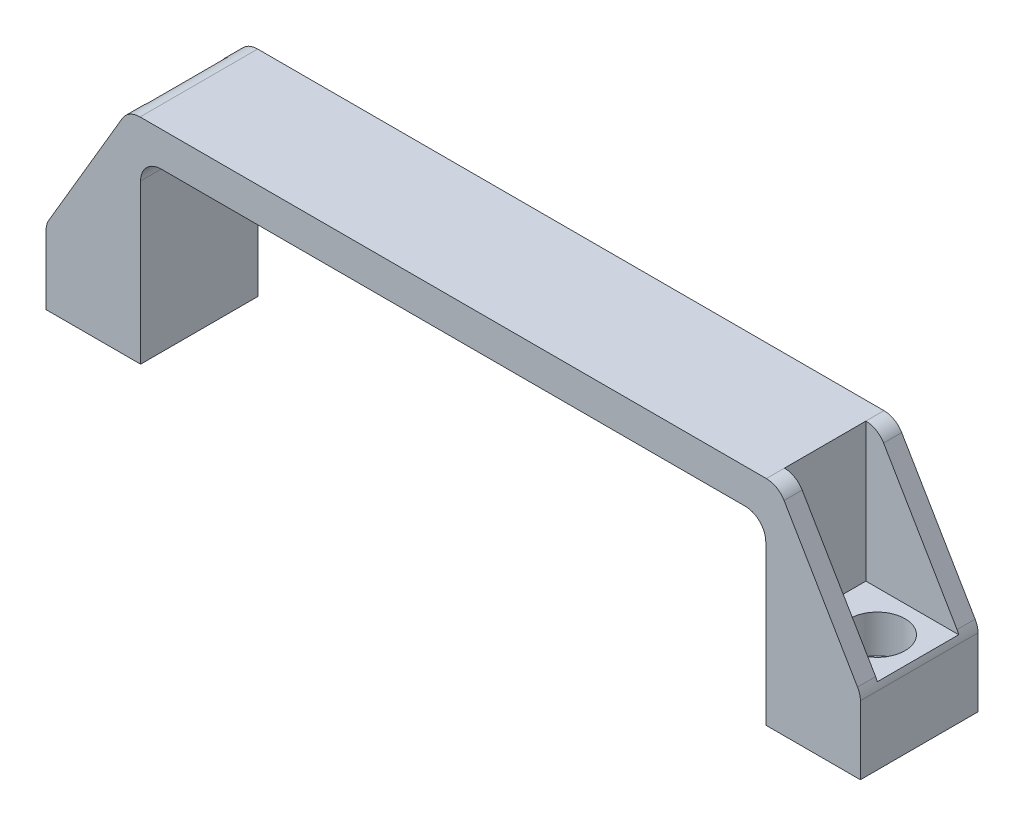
ISO-10303-21;
HEADER;
FILE_DESCRIPTION(('STEP AP214'),'2;1');
FILE_NAME('part.step','',(''),(''),'','','');
FILE_SCHEMA(('AUTOMOTIVE_DESIGN { 1 0 10303 214 1 1 1 1 }'));
ENDSEC;
DATA;
#1=APPLICATION_CONTEXT('core data for automotive mechanical design processes');
#2=APPLICATION_PROTOCOL_DEFINITION('international standard','automotive_design',2000,#1);
#3=PRODUCT_CONTEXT('',#1,'mechanical');
#4=PRODUCT('Part','Part','',(#3));
#5=PRODUCT_RELATED_PRODUCT_CATEGORY('part','',(#4));
#6=PRODUCT_DEFINITION_FORMATION('','',#4);
#7=PRODUCT_DEFINITION_CONTEXT('part definition',#1,'design');
#8=PRODUCT_DEFINITION('design','',#6,#7);
#9=PRODUCT_DEFINITION_SHAPE('','',#8);
#10=(LENGTH_UNIT() NAMED_UNIT(*) SI_UNIT(.MILLI.,.METRE.));
#11=(NAMED_UNIT(*) PLANE_ANGLE_UNIT() SI_UNIT($,.RADIAN.));
#12=(NAMED_UNIT(*) SI_UNIT($,.STERADIAN.) SOLID_ANGLE_UNIT());
#13=UNCERTAINTY_MEASURE_WITH_UNIT(LENGTH_MEASURE(1.E-05),#10,'distance_accuracy_value','');
#14=(GEOMETRIC_REPRESENTATION_CONTEXT(3) GLOBAL_UNCERTAINTY_ASSIGNED_CONTEXT((#13)) GLOBAL_UNIT_ASSIGNED_CONTEXT((#10,
#11,#12)) REPRESENTATION_CONTEXT('',''));
#15=CARTESIAN_POINT('',(0.,0.,0.));
#16=DIRECTION('',(0.,0.,1.));
#17=DIRECTION('',(1.,0.,0.));
#18=AXIS2_PLACEMENT_3D('',#15,#16,#17);
#19=CARTESIAN_POINT('',(187.8,0.,14.3));
#20=DIRECTION('',(0.,1.,0.));
#21=DIRECTION('',(-1.,0.,0.));
#22=AXIS2_PLACEMENT_3D('',#19,#20,#21);
#23=CYLINDRICAL_SURFACE('',#22,4.09999999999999);
#24=CARTESIAN_POINT('',(187.8,0.,14.3));
#25=DIRECTION('',(0.,1.,0.));
#26=DIRECTION('',(-1.,0.,0.));
#27=AXIS2_PLACEMENT_3D('',#24,#25,#26);
#28=CIRCLE('',#27,4.09999999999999);
#29=CARTESIAN_POINT('',(183.7,0.,14.3));
#30=VERTEX_POINT('',#29);
#31=EDGE_CURVE('E229',#30,#30,#28,.T.);
#32=ORIENTED_EDGE('',*,*,#31,.F.);
#33=EDGE_LOOP('',(#32));
#34=FACE_BOUND('',#33,.T.);
#35=CARTESIAN_POINT('',(187.8,9.10000000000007,14.3));
#36=DIRECTION('',(0.,1.,0.));
#37=DIRECTION('',(-1.,0.,0.));
#38=AXIS2_PLACEMENT_3D('',#35,#36,#37);
#39=CIRCLE('',#38,4.09999999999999);
#40=CARTESIAN_POINT('',(183.7,9.10000000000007,14.3));
#41=VERTEX_POINT('',#40);
#42=EDGE_CURVE('E36',#41,#41,#39,.F.);
#43=ORIENTED_EDGE('',*,*,#42,.F.);
#44=EDGE_LOOP('',(#43));
#45=FACE_BOUND('',#44,.T.);
#46=ADVANCED_FACE('F32',(#34,#45),#23,.F.);
#47=CARTESIAN_POINT('',(10.2,0.,14.3));
#48=DIRECTION('',(0.,1.,0.));
#49=DIRECTION('',(-1.,0.,0.));
#50=AXIS2_PLACEMENT_3D('',#47,#48,#49);
#51=CYLINDRICAL_SURFACE('',#50,4.1);
#52=CARTESIAN_POINT('',(10.2,0.,14.3));
#53=DIRECTION('',(0.,1.,0.));
#54=DIRECTION('',(-1.,0.,0.));
#55=AXIS2_PLACEMENT_3D('',#52,#53,#54);
#56=CIRCLE('',#55,4.1);
#57=CARTESIAN_POINT('',(6.1,0.,14.3));
#58=VERTEX_POINT('',#57);
#59=EDGE_CURVE('E226',#58,#58,#56,.T.);
#60=ORIENTED_EDGE('',*,*,#59,.F.);
#61=EDGE_LOOP('',(#60));
#62=FACE_BOUND('',#61,.T.);
#63=CARTESIAN_POINT('',(10.2,9.1,14.3));
#64=DIRECTION('',(0.,1.,0.));
#65=DIRECTION('',(-1.,0.,0.));
#66=AXIS2_PLACEMENT_3D('',#63,#64,#65);
#67=CIRCLE('',#66,4.1);
#68=CARTESIAN_POINT('',(6.1,9.1,14.3));
#69=VERTEX_POINT('',#68);
#70=EDGE_CURVE('E403',#69,#69,#67,.F.);
#71=ORIENTED_EDGE('',*,*,#70,.F.);
#72=EDGE_LOOP('',(#71));
#73=FACE_BOUND('',#72,.T.);
#74=ADVANCED_FACE('F430',(#62,#73),#51,.F.);
#75=CARTESIAN_POINT('',(0.,18.,28.6));
#76=DIRECTION('',(0.86193421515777,-0.507020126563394,0.));
#77=DIRECTION('',(0.507020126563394,0.86193421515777,0.));
#78=AXIS2_PLACEMENT_3D('',#75,#76,#77);
#79=PLANE('',#78);
#80=DIRECTION('',(0.,0.,-1.));
#81=VECTOR('',#80,1.);
#82=CARTESIAN_POINT('',(18.5500591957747,49.535100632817,28.6));
#83=LINE('',#82,#81);
#84=CARTESIAN_POINT('',(18.5500591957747,49.535100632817,28.6));
#85=VERTEX_POINT('',#84);
#86=CARTESIAN_POINT('',(18.5500591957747,49.535100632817,24.2));
#87=VERTEX_POINT('',#86);
#88=EDGE_CURVE('E345',#85,#87,#83,.T.);
#89=ORIENTED_EDGE('',*,*,#88,.T.);
#90=DIRECTION('',(-0.507020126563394,-0.86193421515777,0.));
#91=VECTOR('',#90,1.);
#92=CARTESIAN_POINT('',(0.,18.,24.2));
#93=LINE('',#92,#91);
#94=CARTESIAN_POINT('',(0.690328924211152,19.173559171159,24.2));
#95=VERTEX_POINT('',#94);
#96=EDGE_CURVE('E240',#87,#95,#93,.T.);
#97=ORIENTED_EDGE('',*,*,#96,.T.);
#98=DIRECTION('',(0.,0.,-1.));
#99=VECTOR('',#98,1.);
#100=CARTESIAN_POINT('',(0.690328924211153,19.173559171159,28.6));
#101=LINE('',#100,#99);
#102=CARTESIAN_POINT('',(0.690328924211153,19.173559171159,28.6));
#103=VERTEX_POINT('',#102);
#104=EDGE_CURVE('E379',#95,#103,#101,.F.);
#105=ORIENTED_EDGE('',*,*,#104,.T.);
#106=DIRECTION('',(-0.507020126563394,-0.86193421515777,0.));
#107=VECTOR('',#106,1.);
#108=CARTESIAN_POINT('',(0.,18.,28.6));
#109=LINE('',#108,#107);
#110=EDGE_CURVE('E293',#85,#103,#109,.T.);
#111=ORIENTED_EDGE('',*,*,#110,.F.);
#112=EDGE_LOOP('',(#89,#97,#105,#111));
#113=FACE_BOUND('',#112,.T.);
#114=ADVANCED_FACE('F436',(#113),#79,.F.);
#115=CARTESIAN_POINT('',(198.,18.,28.6));
#116=DIRECTION('',(-0.861934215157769,-0.507020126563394,0.));
#117=DIRECTION('',(0.507020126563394,-0.861934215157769,0.));
#118=AXIS2_PLACEMENT_3D('',#115,#116,#117);
#119=PLANE('',#118);
#120=DIRECTION('',(0.,0.,-1.));
#121=VECTOR('',#120,1.);
#122=CARTESIAN_POINT('',(179.449940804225,49.535100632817,28.6));
#123=LINE('',#122,#121);
#124=CARTESIAN_POINT('',(179.449940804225,49.535100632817,0.));
#125=VERTEX_POINT('',#124);
#126=CARTESIAN_POINT('',(179.449940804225,49.535100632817,4.4));
#127=VERTEX_POINT('',#126);
#128=EDGE_CURVE('E339',#125,#127,#123,.F.);
#129=ORIENTED_EDGE('',*,*,#128,.T.);
#130=DIRECTION('',(0.507020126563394,-0.861934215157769,0.));
#131=VECTOR('',#130,1.);
#132=CARTESIAN_POINT('',(198.,18.,4.4));
#133=LINE('',#132,#131);
#134=CARTESIAN_POINT('',(197.309671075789,19.173559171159,4.4));
#135=VERTEX_POINT('',#134);
#136=EDGE_CURVE('E263',#127,#135,#133,.T.);
#137=ORIENTED_EDGE('',*,*,#136,.T.);
#138=DIRECTION('',(0.,0.,-1.));
#139=VECTOR('',#138,1.);
#140=CARTESIAN_POINT('',(197.309671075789,19.173559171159,28.6));
#141=LINE('',#140,#139);
#142=CARTESIAN_POINT('',(197.309671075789,19.173559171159,0.));
#143=VERTEX_POINT('',#142);
#144=EDGE_CURVE('E387',#135,#143,#141,.T.);
#145=ORIENTED_EDGE('',*,*,#144,.T.);
#146=DIRECTION('',(-0.507020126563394,0.861934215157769,0.));
#147=VECTOR('',#146,1.);
#148=CARTESIAN_POINT('',(198.,18.,0.));
#149=LINE('',#148,#147);
#150=EDGE_CURVE('E313',#143,#125,#149,.T.);
#151=ORIENTED_EDGE('',*,*,#150,.T.);
#152=EDGE_LOOP('',(#129,#137,#145,#151));
#153=FACE_BOUND('',#152,.T.);
#154=ADVANCED_FACE('F494',(#153),#119,.F.);
#155=CARTESIAN_POINT('',(175.140269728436,47.,28.6));
#156=DIRECTION('',(0.,0.,-1.));
#157=DIRECTION('',(-1.,0.,0.));
#158=AXIS2_PLACEMENT_3D('',#155,#156,#157);
#159=CYLINDRICAL_SURFACE('',#158,5.);
#160=CARTESIAN_POINT('',(175.140269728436,47.,4.4));
#161=DIRECTION('',(0.,0.,-1.));
#162=DIRECTION('',(-1.,0.,0.));
#163=AXIS2_PLACEMENT_3D('',#160,#161,#162);
#164=CIRCLE('',#163,5.);
#165=CARTESIAN_POINT('',(175.140269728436,52.,4.4));
#166=VERTEX_POINT('',#165);
#167=EDGE_CURVE('E266',#127,#166,#164,.F.);
#168=ORIENTED_EDGE('',*,*,#167,.F.);
#169=ORIENTED_EDGE('',*,*,#128,.F.);
#170=CARTESIAN_POINT('',(175.140269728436,47.,0.));
#171=DIRECTION('',(0.,0.,-1.));
#172=DIRECTION('',(-1.,0.,0.));
#173=AXIS2_PLACEMENT_3D('',#170,#171,#172);
#174=CIRCLE('',#173,5.);
#175=CARTESIAN_POINT('',(175.140269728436,52.,0.));
#176=VERTEX_POINT('',#175);
#177=EDGE_CURVE('E335',#176,#125,#174,.T.);
#178=ORIENTED_EDGE('',*,*,#177,.F.);
#179=DIRECTION('',(0.,0.,-1.));
#180=VECTOR('',#179,1.);
#181=CARTESIAN_POINT('',(175.140269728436,52.,28.6));
#182=LINE('',#181,#180);
#183=EDGE_CURVE('E331',#166,#176,#182,.T.);
#184=ORIENTED_EDGE('',*,*,#183,.F.);
#185=EDGE_LOOP('',(#168,#169,#178,#184));
#186=FACE_BOUND('',#185,.T.);
#187=ADVANCED_FACE('F521',(#186),#159,.T.);
#188=CARTESIAN_POINT('',(0.,0.,28.6));
#189=DIRECTION('',(1.,0.,0.));
#190=DIRECTION('',(0.,0.,-1.));
#191=AXIS2_PLACEMENT_3D('',#188,#189,#190);
#192=PLANE('',#191);
#193=DIRECTION('',(0.,-1.,0.));
#194=VECTOR('',#193,1.);
#195=CARTESIAN_POINT('',(0.,0.,28.6));
#196=LINE('',#195,#194);
#197=CARTESIAN_POINT('',(0.,16.638458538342,28.6));
#198=VERTEX_POINT('',#197);
#199=CARTESIAN_POINT('',(0.,0.,28.6));
#200=VERTEX_POINT('',#199);
#201=EDGE_CURVE('E269',#198,#200,#196,.T.);
#202=ORIENTED_EDGE('',*,*,#201,.F.);
#203=DIRECTION('',(0.,0.,-1.));
#204=VECTOR('',#203,1.);
#205=CARTESIAN_POINT('',(0.,16.638458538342,28.6));
#206=LINE('',#205,#204);
#207=CARTESIAN_POINT('',(0.,16.638458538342,0.));
#208=VERTEX_POINT('',#207);
#209=EDGE_CURVE('E372',#198,#208,#206,.T.);
#210=ORIENTED_EDGE('',*,*,#209,.T.);
#211=DIRECTION('',(0.,-1.,0.));
#212=VECTOR('',#211,1.);
#213=CARTESIAN_POINT('',(0.,0.,0.));
#214=LINE('',#213,#212);
#215=CARTESIAN_POINT('',(0.,0.,0.));
#216=VERTEX_POINT('',#215);
#217=EDGE_CURVE('E268',#208,#216,#214,.T.);
#218=ORIENTED_EDGE('',*,*,#217,.T.);
#219=DIRECTION('',(0.,0.,-1.));
#220=VECTOR('',#219,1.);
#221=CARTESIAN_POINT('',(0.,0.,28.6));
#222=LINE('',#221,#220);
#223=EDGE_CURVE('E328',#200,#216,#222,.T.);
#224=ORIENTED_EDGE('',*,*,#223,.F.);
#225=EDGE_LOOP('',(#202,#210,#218,#224));
#226=FACE_BOUND('',#225,.T.);
#227=ADVANCED_FACE('F517',(#226),#192,.F.);
#228=CARTESIAN_POINT('',(0.,0.,28.6));
#229=DIRECTION('',(0.,1.,0.));
#230=DIRECTION('',(0.,0.,1.));
#231=AXIS2_PLACEMENT_3D('',#228,#229,#230);
#232=PLANE('',#231);
#233=ORIENTED_EDGE('',*,*,#59,.T.);
#234=EDGE_LOOP('',(#233));
#235=FACE_BOUND('',#234,.T.);
#236=DIRECTION('',(1.,0.,0.));
#237=VECTOR('',#236,1.);
#238=CARTESIAN_POINT('',(0.,0.,0.));
#239=LINE('',#238,#237);
#240=CARTESIAN_POINT('',(23.,0.,0.));
#241=VERTEX_POINT('',#240);
#242=EDGE_CURVE('E298',#216,#241,#239,.T.);
#243=ORIENTED_EDGE('',*,*,#242,.T.);
#244=DIRECTION('',(0.,0.,-1.));
#245=VECTOR('',#244,1.);
#246=CARTESIAN_POINT('',(23.,0.,28.6));
#247=LINE('',#246,#245);
#248=CARTESIAN_POINT('',(23.,0.,28.6));
#249=VERTEX_POINT('',#248);
#250=EDGE_CURVE('E325',#249,#241,#247,.T.);
#251=ORIENTED_EDGE('',*,*,#250,.F.);
#252=DIRECTION('',(1.,0.,0.));
#253=VECTOR('',#252,1.);
#254=CARTESIAN_POINT('',(0.,0.,28.6));
#255=LINE('',#254,#253);
#256=EDGE_CURVE('E271',#200,#249,#255,.T.);
#257=ORIENTED_EDGE('',*,*,#256,.F.);
#258=ORIENTED_EDGE('',*,*,#223,.T.);
#259=EDGE_LOOP('',(#243,#251,#257,#258));
#260=FACE_BOUND('',#259,.T.);
#261=ADVANCED_FACE('F513',(#235,#260),#232,.F.);
#262=CARTESIAN_POINT('',(23.,0.,28.6));
#263=DIRECTION('',(-1.,0.,0.));
#264=DIRECTION('',(0.,0.,1.));
#265=AXIS2_PLACEMENT_3D('',#262,#263,#264);
#266=PLANE('',#265);
#267=DIRECTION('',(0.,1.,0.));
#268=VECTOR('',#267,1.);
#269=CARTESIAN_POINT('',(23.,0.,0.));
#270=LINE('',#269,#268);
#271=CARTESIAN_POINT('',(23.,38.6,0.));
#272=VERTEX_POINT('',#271);
#273=EDGE_CURVE('E300',#241,#272,#270,.T.);
#274=ORIENTED_EDGE('',*,*,#273,.T.);
#275=DIRECTION('',(0.,0.,-1.));
#276=VECTOR('',#275,1.);
#277=CARTESIAN_POINT('',(23.,38.6,28.6));
#278=LINE('',#277,#276);
#279=CARTESIAN_POINT('',(23.,38.6,28.6));
#280=VERTEX_POINT('',#279);
#281=EDGE_CURVE('E359',#272,#280,#278,.F.);
#282=ORIENTED_EDGE('',*,*,#281,.T.);
#283=DIRECTION('',(0.,1.,0.));
#284=VECTOR('',#283,1.);
#285=CARTESIAN_POINT('',(23.,0.,28.6));
#286=LINE('',#285,#284);
#287=EDGE_CURVE('E274',#249,#280,#286,.T.);
#288=ORIENTED_EDGE('',*,*,#287,.F.);
#289=ORIENTED_EDGE('',*,*,#250,.T.);
#290=EDGE_LOOP('',(#274,#282,#288,#289));
#291=FACE_BOUND('',#290,.T.);
#292=ADVANCED_FACE('F509',(#291),#266,.F.);
#293=CARTESIAN_POINT('',(23.,43.6,28.6));
#294=DIRECTION('',(0.,1.,0.));
#295=DIRECTION('',(-1.,0.,0.));
#296=AXIS2_PLACEMENT_3D('',#293,#294,#295);
#297=PLANE('',#296);
#298=DIRECTION('',(1.,0.,0.));
#299=VECTOR('',#298,1.);
#300=CARTESIAN_POINT('',(23.,43.6,28.6));
#301=LINE('',#300,#299);
#302=CARTESIAN_POINT('',(28.,43.6,28.6));
#303=VERTEX_POINT('',#302);
#304=CARTESIAN_POINT('',(170.,43.6,28.6));
#305=VERTEX_POINT('',#304);
#306=EDGE_CURVE('E277',#303,#305,#301,.T.);
#307=ORIENTED_EDGE('',*,*,#306,.F.);
#308=DIRECTION('',(0.,0.,-1.));
#309=VECTOR('',#308,1.);
#310=CARTESIAN_POINT('',(28.,43.6,0.));
#311=LINE('',#310,#309);
#312=CARTESIAN_POINT('',(28.,43.6,0.));
#313=VERTEX_POINT('',#312);
#314=EDGE_CURVE('E356',#303,#313,#311,.T.);
#315=ORIENTED_EDGE('',*,*,#314,.T.);
#316=DIRECTION('',(1.,0.,0.));
#317=VECTOR('',#316,1.);
#318=CARTESIAN_POINT('',(23.,43.6,0.));
#319=LINE('',#318,#317);
#320=CARTESIAN_POINT('',(170.,43.6,0.));
#321=VERTEX_POINT('',#320);
#322=EDGE_CURVE('E303',#313,#321,#319,.T.);
#323=ORIENTED_EDGE('',*,*,#322,.T.);
#324=DIRECTION('',(0.,0.,-1.));
#325=VECTOR('',#324,1.);
#326=CARTESIAN_POINT('',(170.,43.6,28.6));
#327=LINE('',#326,#325);
#328=EDGE_CURVE('E354',#321,#305,#327,.F.);
#329=ORIENTED_EDGE('',*,*,#328,.T.);
#330=EDGE_LOOP('',(#307,#315,#323,#329));
#331=FACE_BOUND('',#330,.T.);
#332=ADVANCED_FACE('F505',(#331),#297,.F.);
#333=CARTESIAN_POINT('',(175.,0.,28.6));
#334=DIRECTION('',(1.,0.,0.));
#335=DIRECTION('',(0.,0.,-1.));
#336=AXIS2_PLACEMENT_3D('',#333,#334,#335);
#337=PLANE('',#336);
#338=DIRECTION('',(0.,-1.,0.));
#339=VECTOR('',#338,1.);
#340=CARTESIAN_POINT('',(175.,0.,28.6));
#341=LINE('',#340,#339);
#342=CARTESIAN_POINT('',(175.,38.6,28.6));
#343=VERTEX_POINT('',#342);
#344=CARTESIAN_POINT('',(175.,0.,28.6));
#345=VERTEX_POINT('',#344);
#346=EDGE_CURVE('E280',#343,#345,#341,.T.);
#347=ORIENTED_EDGE('',*,*,#346,.F.);
#348=DIRECTION('',(0.,0.,-1.));
#349=VECTOR('',#348,1.);
#350=CARTESIAN_POINT('',(175.,38.6,0.));
#351=LINE('',#350,#349);
#352=CARTESIAN_POINT('',(175.,38.6,0.));
#353=VERTEX_POINT('',#352);
#354=EDGE_CURVE('E361',#343,#353,#351,.T.);
#355=ORIENTED_EDGE('',*,*,#354,.T.);
#356=DIRECTION('',(0.,-1.,0.));
#357=VECTOR('',#356,1.);
#358=CARTESIAN_POINT('',(175.,0.,0.));
#359=LINE('',#358,#357);
#360=CARTESIAN_POINT('',(175.,0.,0.));
#361=VERTEX_POINT('',#360);
#362=EDGE_CURVE('E306',#353,#361,#359,.T.);
#363=ORIENTED_EDGE('',*,*,#362,.T.);
#364=DIRECTION('',(0.,0.,-1.));
#365=VECTOR('',#364,1.);
#366=CARTESIAN_POINT('',(175.,0.,28.6));
#367=LINE('',#366,#365);
#368=EDGE_CURVE('E322',#345,#361,#367,.T.);
#369=ORIENTED_EDGE('',*,*,#368,.F.);
#370=EDGE_LOOP('',(#347,#355,#363,#369));
#371=FACE_BOUND('',#370,.T.);
#372=ADVANCED_FACE('F501',(#371),#337,.F.);
#373=CARTESIAN_POINT('',(198.,0.,28.6));
#374=DIRECTION('',(0.,1.,0.));
#375=DIRECTION('',(-1.,0.,0.));
#376=AXIS2_PLACEMENT_3D('',#373,#374,#375);
#377=PLANE('',#376);
#378=ORIENTED_EDGE('',*,*,#31,.T.);
#379=EDGE_LOOP('',(#378));
#380=FACE_BOUND('',#379,.T.);
#381=DIRECTION('',(1.,0.,0.));
#382=VECTOR('',#381,1.);
#383=CARTESIAN_POINT('',(198.,0.,0.));
#384=LINE('',#383,#382);
#385=CARTESIAN_POINT('',(198.,0.,0.));
#386=VERTEX_POINT('',#385);
#387=EDGE_CURVE('E308',#361,#386,#384,.T.);
#388=ORIENTED_EDGE('',*,*,#387,.T.);
#389=DIRECTION('',(0.,0.,-1.));
#390=VECTOR('',#389,1.);
#391=CARTESIAN_POINT('',(198.,0.,28.6));
#392=LINE('',#391,#390);
#393=CARTESIAN_POINT('',(198.,0.,28.6));
#394=VERTEX_POINT('',#393);
#395=EDGE_CURVE('E296',#394,#386,#392,.T.);
#396=ORIENTED_EDGE('',*,*,#395,.F.);
#397=DIRECTION('',(1.,0.,0.));
#398=VECTOR('',#397,1.);
#399=CARTESIAN_POINT('',(198.,0.,28.6));
#400=LINE('',#399,#398);
#401=EDGE_CURVE('E282',#345,#394,#400,.T.);
#402=ORIENTED_EDGE('',*,*,#401,.F.);
#403=ORIENTED_EDGE('',*,*,#368,.T.);
#404=EDGE_LOOP('',(#388,#396,#402,#403));
#405=FACE_BOUND('',#404,.T.);
#406=ADVANCED_FACE('F497',(#380,#405),#377,.F.);
#407=CARTESIAN_POINT('',(198.,0.,28.6));
#408=DIRECTION('',(-1.,0.,0.));
#409=DIRECTION('',(0.,0.,1.));
#410=AXIS2_PLACEMENT_3D('',#407,#408,#409);
#411=PLANE('',#410);
#412=DIRECTION('',(0.,1.,0.));
#413=VECTOR('',#412,1.);
#414=CARTESIAN_POINT('',(198.,0.,0.));
#415=LINE('',#414,#413);
#416=CARTESIAN_POINT('',(198.,16.638458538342,0.));
#417=VERTEX_POINT('',#416);
#418=EDGE_CURVE('E310',#386,#417,#415,.T.);
#419=ORIENTED_EDGE('',*,*,#418,.T.);
#420=DIRECTION('',(0.,0.,-1.));
#421=VECTOR('',#420,1.);
#422=CARTESIAN_POINT('',(198.,16.638458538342,28.6));
#423=LINE('',#422,#421);
#424=CARTESIAN_POINT('',(198.,16.638458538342,28.6));
#425=VERTEX_POINT('',#424);
#426=EDGE_CURVE('E391',#417,#425,#423,.F.);
#427=ORIENTED_EDGE('',*,*,#426,.T.);
#428=DIRECTION('',(0.,1.,0.));
#429=VECTOR('',#428,1.);
#430=CARTESIAN_POINT('',(198.,0.,28.6));
#431=LINE('',#430,#429);
#432=EDGE_CURVE('E284',#394,#425,#431,.T.);
#433=ORIENTED_EDGE('',*,*,#432,.F.);
#434=ORIENTED_EDGE('',*,*,#395,.T.);
#435=EDGE_LOOP('',(#419,#427,#433,#434));
#436=FACE_BOUND('',#435,.T.);
#437=ADVANCED_FACE('F492',(#436),#411,.F.);
#438=CARTESIAN_POINT('',(197.309671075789,19.173559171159,28.6));
#439=VERTEX_POINT('',#438);
#440=CARTESIAN_POINT('',(197.309671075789,19.173559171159,24.2));
#441=VERTEX_POINT('',#440);
#442=EDGE_CURVE('E388',#439,#441,#141,.T.);
#443=ORIENTED_EDGE('',*,*,#442,.T.);
#444=DIRECTION('',(-0.507020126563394,0.861934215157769,0.));
#445=VECTOR('',#444,1.);
#446=CARTESIAN_POINT('',(198.,18.,24.2));
#447=LINE('',#446,#445);
#448=CARTESIAN_POINT('',(179.449940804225,49.535100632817,24.2));
#449=VERTEX_POINT('',#448);
#450=EDGE_CURVE('E257',#441,#449,#447,.T.);
#451=ORIENTED_EDGE('',*,*,#450,.T.);
#452=CARTESIAN_POINT('',(179.449940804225,49.535100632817,28.6));
#453=VERTEX_POINT('',#452);
#454=EDGE_CURVE('E338',#449,#453,#123,.F.);
#455=ORIENTED_EDGE('',*,*,#454,.T.);
#456=DIRECTION('',(-0.507020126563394,0.861934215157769,0.));
#457=VECTOR('',#456,1.);
#458=CARTESIAN_POINT('',(198.,18.,28.6));
#459=LINE('',#458,#457);
#460=EDGE_CURVE('E287',#439,#453,#459,.T.);
#461=ORIENTED_EDGE('',*,*,#460,.F.);
#462=EDGE_LOOP('',(#443,#451,#455,#461));
#463=FACE_BOUND('',#462,.T.);
#464=ADVANCED_FACE('F488',(#463),#119,.F.);
#465=CARTESIAN_POINT('',(20.,52.,28.6));
#466=DIRECTION('',(0.,-1.,0.));
#467=DIRECTION('',(1.,0.,0.));
#468=AXIS2_PLACEMENT_3D('',#465,#466,#467);
#469=PLANE('',#468);
#470=DIRECTION('',(-1.,0.,0.));
#471=VECTOR('',#470,1.);
#472=CARTESIAN_POINT('',(20.,52.,0.));
#473=LINE('',#472,#471);
#474=CARTESIAN_POINT('',(22.8597302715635,52.,0.));
#475=VERTEX_POINT('',#474);
#476=EDGE_CURVE('E315',#176,#475,#473,.T.);
#477=ORIENTED_EDGE('',*,*,#476,.T.);
#478=DIRECTION('',(0.,0.,-1.));
#479=VECTOR('',#478,1.);
#480=CARTESIAN_POINT('',(22.8597302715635,52.,28.6));
#481=LINE('',#480,#479);
#482=CARTESIAN_POINT('',(22.8597302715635,52.,28.6));
#483=VERTEX_POINT('',#482);
#484=EDGE_CURVE('E350',#475,#483,#481,.F.);
#485=ORIENTED_EDGE('',*,*,#484,.T.);
#486=DIRECTION('',(-1.,0.,0.));
#487=VECTOR('',#486,1.);
#488=CARTESIAN_POINT('',(20.,52.,28.6));
#489=LINE('',#488,#487);
#490=CARTESIAN_POINT('',(175.140269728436,52.,28.6));
#491=VERTEX_POINT('',#490);
#492=EDGE_CURVE('E290',#491,#483,#489,.T.);
#493=ORIENTED_EDGE('',*,*,#492,.F.);
#494=CARTESIAN_POINT('',(175.140269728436,52.,24.2));
#495=VERTEX_POINT('',#494);
#496=EDGE_CURVE('E332',#491,#495,#182,.T.);
#497=ORIENTED_EDGE('',*,*,#496,.T.);
#498=DIRECTION('',(0.,0.,1.));
#499=VECTOR('',#498,1.);
#500=CARTESIAN_POINT('',(175.140269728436,52.,4.4));
#501=LINE('',#500,#499);
#502=EDGE_CURVE('E245',#166,#495,#501,.T.);
#503=ORIENTED_EDGE('',*,*,#502,.F.);
#504=ORIENTED_EDGE('',*,*,#183,.T.);
#505=EDGE_LOOP('',(#477,#485,#493,#497,#503,#504));
#506=FACE_BOUND('',#505,.T.);
#507=ADVANCED_FACE('F484',(#506),#469,.F.);
#508=CARTESIAN_POINT('',(0.690328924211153,19.173559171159,0.));
#509=VERTEX_POINT('',#508);
#510=CARTESIAN_POINT('',(0.690328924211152,19.173559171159,4.40000000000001));
#511=VERTEX_POINT('',#510);
#512=EDGE_CURVE('E380',#509,#511,#101,.F.);
#513=ORIENTED_EDGE('',*,*,#512,.T.);
#514=DIRECTION('',(0.507020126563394,0.86193421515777,0.));
#515=VECTOR('',#514,1.);
#516=CARTESIAN_POINT('',(0.,18.,4.4));
#517=LINE('',#516,#515);
#518=CARTESIAN_POINT('',(18.5500591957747,49.535100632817,4.4));
#519=VERTEX_POINT('',#518);
#520=EDGE_CURVE('E234',#511,#519,#517,.T.);
#521=ORIENTED_EDGE('',*,*,#520,.T.);
#522=CARTESIAN_POINT('',(18.5500591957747,49.535100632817,0.));
#523=VERTEX_POINT('',#522);
#524=EDGE_CURVE('E344',#519,#523,#83,.T.);
#525=ORIENTED_EDGE('',*,*,#524,.T.);
#526=DIRECTION('',(-0.507020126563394,-0.86193421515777,0.));
#527=VECTOR('',#526,1.);
#528=CARTESIAN_POINT('',(0.,18.,0.));
#529=LINE('',#528,#527);
#530=EDGE_CURVE('E272',#523,#509,#529,.T.);
#531=ORIENTED_EDGE('',*,*,#530,.T.);
#532=EDGE_LOOP('',(#513,#521,#525,#531));
#533=FACE_BOUND('',#532,.T.);
#534=ADVANCED_FACE('F476',(#533),#79,.F.);
#535=CARTESIAN_POINT('',(0.,52.,28.6));
#536=DIRECTION('',(0.,0.,-1.));
#537=DIRECTION('',(-1.,0.,0.));
#538=AXIS2_PLACEMENT_3D('',#535,#536,#537);
#539=PLANE('',#538);
#540=ORIENTED_EDGE('',*,*,#110,.T.);
#541=CARTESIAN_POINT('',(5.,16.638458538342,28.6));
#542=DIRECTION('',(0.,0.,-1.));
#543=DIRECTION('',(-1.,0.,0.));
#544=AXIS2_PLACEMENT_3D('',#541,#542,#543);
#545=CIRCLE('',#544,5.);
#546=EDGE_CURVE('E385',#103,#198,#545,.F.);
#547=ORIENTED_EDGE('',*,*,#546,.T.);
#548=ORIENTED_EDGE('',*,*,#201,.T.);
#549=ORIENTED_EDGE('',*,*,#256,.T.);
#550=ORIENTED_EDGE('',*,*,#287,.T.);
#551=CARTESIAN_POINT('',(28.,38.6,28.6));
#552=DIRECTION('',(0.,0.,-1.));
#553=DIRECTION('',(-1.,0.,0.));
#554=AXIS2_PLACEMENT_3D('',#551,#552,#553);
#555=CIRCLE('',#554,5.);
#556=EDGE_CURVE('E366',#280,#303,#555,.T.);
#557=ORIENTED_EDGE('',*,*,#556,.T.);
#558=ORIENTED_EDGE('',*,*,#306,.T.);
#559=CARTESIAN_POINT('',(170.,38.6,28.6));
#560=DIRECTION('',(0.,0.,-1.));
#561=DIRECTION('',(-1.,0.,0.));
#562=AXIS2_PLACEMENT_3D('',#559,#560,#561);
#563=CIRCLE('',#562,5.);
#564=EDGE_CURVE('E370',#305,#343,#563,.T.);
#565=ORIENTED_EDGE('',*,*,#564,.T.);
#566=ORIENTED_EDGE('',*,*,#346,.T.);
#567=ORIENTED_EDGE('',*,*,#401,.T.);
#568=ORIENTED_EDGE('',*,*,#432,.T.);
#569=CARTESIAN_POINT('',(193.,16.638458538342,28.6));
#570=DIRECTION('',(0.,0.,-1.));
#571=DIRECTION('',(-1.,0.,0.));
#572=AXIS2_PLACEMENT_3D('',#569,#570,#571);
#573=CIRCLE('',#572,5.);
#574=EDGE_CURVE('E383',#425,#439,#573,.F.);
#575=ORIENTED_EDGE('',*,*,#574,.T.);
#576=ORIENTED_EDGE('',*,*,#460,.T.);
#577=CARTESIAN_POINT('',(175.140269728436,47.,28.6));
#578=DIRECTION('',(0.,0.,-1.));
#579=DIRECTION('',(-1.,0.,0.));
#580=AXIS2_PLACEMENT_3D('',#577,#578,#579);
#581=CIRCLE('',#580,5.);
#582=EDGE_CURVE('E342',#453,#491,#581,.F.);
#583=ORIENTED_EDGE('',*,*,#582,.T.);
#584=ORIENTED_EDGE('',*,*,#492,.T.);
#585=CARTESIAN_POINT('',(22.8597302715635,47.,28.6));
#586=DIRECTION('',(0.,0.,-1.));
#587=DIRECTION('',(-1.,0.,0.));
#588=AXIS2_PLACEMENT_3D('',#585,#586,#587);
#589=CIRCLE('',#588,5.);
#590=EDGE_CURVE('E352',#483,#85,#589,.F.);
#591=ORIENTED_EDGE('',*,*,#590,.T.);
#592=EDGE_LOOP('',(#540,#547,#548,#549,#550,#557,#558,#565,#566,#567,#568,#575,#576,#583,#584,#591));
#593=FACE_BOUND('',#592,.T.);
#594=ADVANCED_FACE('F472',(#593),#539,.F.);
#595=CARTESIAN_POINT('',(0.,52.,0.));
#596=DIRECTION('',(0.,0.,-1.));
#597=DIRECTION('',(-1.,0.,0.));
#598=AXIS2_PLACEMENT_3D('',#595,#596,#597);
#599=PLANE('',#598);
#600=ORIENTED_EDGE('',*,*,#217,.F.);
#601=CARTESIAN_POINT('',(5.,16.638458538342,0.));
#602=DIRECTION('',(0.,0.,-1.));
#603=DIRECTION('',(-1.,0.,0.));
#604=AXIS2_PLACEMENT_3D('',#601,#602,#603);
#605=CIRCLE('',#604,5.);
#606=EDGE_CURVE('E377',#208,#509,#605,.T.);
#607=ORIENTED_EDGE('',*,*,#606,.T.);
#608=ORIENTED_EDGE('',*,*,#530,.F.);
#609=CARTESIAN_POINT('',(22.8597302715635,47.,0.));
#610=DIRECTION('',(0.,0.,-1.));
#611=DIRECTION('',(-1.,0.,0.));
#612=AXIS2_PLACEMENT_3D('',#609,#610,#611);
#613=CIRCLE('',#612,5.);
#614=EDGE_CURVE('E348',#523,#475,#613,.T.);
#615=ORIENTED_EDGE('',*,*,#614,.T.);
#616=ORIENTED_EDGE('',*,*,#476,.F.);
#617=ORIENTED_EDGE('',*,*,#177,.T.);
#618=ORIENTED_EDGE('',*,*,#150,.F.);
#619=CARTESIAN_POINT('',(193.,16.638458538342,0.));
#620=DIRECTION('',(0.,0.,-1.));
#621=DIRECTION('',(-1.,0.,0.));
#622=AXIS2_PLACEMENT_3D('',#619,#620,#621);
#623=CIRCLE('',#622,5.);
#624=EDGE_CURVE('E375',#143,#417,#623,.T.);
#625=ORIENTED_EDGE('',*,*,#624,.T.);
#626=ORIENTED_EDGE('',*,*,#418,.F.);
#627=ORIENTED_EDGE('',*,*,#387,.F.);
#628=ORIENTED_EDGE('',*,*,#362,.F.);
#629=CARTESIAN_POINT('',(170.,38.6,0.));
#630=DIRECTION('',(0.,0.,-1.));
#631=DIRECTION('',(-1.,0.,0.));
#632=AXIS2_PLACEMENT_3D('',#629,#630,#631);
#633=CIRCLE('',#632,5.);
#634=EDGE_CURVE('E368',#353,#321,#633,.F.);
#635=ORIENTED_EDGE('',*,*,#634,.T.);
#636=ORIENTED_EDGE('',*,*,#322,.F.);
#637=CARTESIAN_POINT('',(28.,38.6,0.));
#638=DIRECTION('',(0.,0.,-1.));
#639=DIRECTION('',(-1.,0.,0.));
#640=AXIS2_PLACEMENT_3D('',#637,#638,#639);
#641=CIRCLE('',#640,5.);
#642=EDGE_CURVE('E364',#313,#272,#641,.F.);
#643=ORIENTED_EDGE('',*,*,#642,.T.);
#644=ORIENTED_EDGE('',*,*,#273,.F.);
#645=ORIENTED_EDGE('',*,*,#242,.F.);
#646=EDGE_LOOP('',(#600,#607,#608,#615,#616,#617,#618,#625,#626,#627,#628,#635,#636,#643,#644,#645));
#647=FACE_BOUND('',#646,.T.);
#648=ADVANCED_FACE('F475',(#647),#599,.T.);
#649=CARTESIAN_POINT('',(175.140269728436,47.,24.2));
#650=DIRECTION('',(0.,0.,1.));
#651=DIRECTION('',(1.,0.,0.));
#652=AXIS2_PLACEMENT_3D('',#649,#650,#651);
#653=CIRCLE('',#652,5.);
#654=EDGE_CURVE('E261',#495,#449,#653,.F.);
#655=ORIENTED_EDGE('',*,*,#654,.F.);
#656=ORIENTED_EDGE('',*,*,#496,.F.);
#657=ORIENTED_EDGE('',*,*,#582,.F.);
#658=ORIENTED_EDGE('',*,*,#454,.F.);
#659=EDGE_LOOP('',(#655,#656,#657,#658));
#660=FACE_BOUND('',#659,.T.);
#661=ADVANCED_FACE('F480',(#660),#159,.T.);
#662=CARTESIAN_POINT('',(22.8597302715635,47.,28.6));
#663=DIRECTION('',(0.,0.,-1.));
#664=DIRECTION('',(-1.,0.,0.));
#665=AXIS2_PLACEMENT_3D('',#662,#663,#664);
#666=CYLINDRICAL_SURFACE('',#665,5.);
#667=CARTESIAN_POINT('',(22.8597302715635,47.,24.2));
#668=DIRECTION('',(0.,0.,1.));
#669=DIRECTION('',(1.,0.,0.));
#670=AXIS2_PLACEMENT_3D('',#667,#668,#669);
#671=CIRCLE('',#670,5.);
#672=CARTESIAN_POINT('',(20.,51.1014561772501,24.2));
#673=VERTEX_POINT('',#672);
#674=EDGE_CURVE('E243',#87,#673,#671,.F.);
#675=ORIENTED_EDGE('',*,*,#674,.F.);
#676=ORIENTED_EDGE('',*,*,#88,.F.);
#677=ORIENTED_EDGE('',*,*,#590,.F.);
#678=ORIENTED_EDGE('',*,*,#484,.F.);
#679=ORIENTED_EDGE('',*,*,#614,.F.);
#680=ORIENTED_EDGE('',*,*,#524,.F.);
#681=CARTESIAN_POINT('',(22.8597302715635,47.,4.4));
#682=DIRECTION('',(0.,0.,-1.));
#683=DIRECTION('',(-1.,0.,0.));
#684=AXIS2_PLACEMENT_3D('',#681,#682,#683);
#685=CIRCLE('',#684,5.);
#686=CARTESIAN_POINT('',(20.,51.1014561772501,4.4));
#687=VERTEX_POINT('',#686);
#688=EDGE_CURVE('E238',#687,#519,#685,.F.);
#689=ORIENTED_EDGE('',*,*,#688,.F.);
#690=DIRECTION('',(0.,0.,-1.));
#691=VECTOR('',#690,1.);
#692=CARTESIAN_POINT('',(20.,51.1014561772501,28.6));
#693=LINE('',#692,#691);
#694=EDGE_CURVE('E12',#673,#687,#693,.T.);
#695=ORIENTED_EDGE('',*,*,#694,.F.);
#696=EDGE_LOOP('',(#675,#676,#677,#678,#679,#680,#689,#695));
#697=FACE_BOUND('',#696,.T.);
#698=ADVANCED_FACE('F525',(#697),#666,.T.);
#699=CARTESIAN_POINT('',(28.,38.6,28.6));
#700=DIRECTION('',(0.,0.,1.));
#701=DIRECTION('',(1.,0.,0.));
#702=AXIS2_PLACEMENT_3D('',#699,#700,#701);
#703=CYLINDRICAL_SURFACE('',#702,5.);
#704=ORIENTED_EDGE('',*,*,#556,.F.);
#705=ORIENTED_EDGE('',*,*,#281,.F.);
#706=ORIENTED_EDGE('',*,*,#642,.F.);
#707=ORIENTED_EDGE('',*,*,#314,.F.);
#708=EDGE_LOOP('',(#704,#705,#706,#707));
#709=FACE_BOUND('',#708,.T.);
#710=ADVANCED_FACE('F529',(#709),#703,.F.);
#711=CARTESIAN_POINT('',(170.,38.6,28.6));
#712=DIRECTION('',(0.,0.,1.));
#713=DIRECTION('',(1.,0.,0.));
#714=AXIS2_PLACEMENT_3D('',#711,#712,#713);
#715=CYLINDRICAL_SURFACE('',#714,5.);
#716=ORIENTED_EDGE('',*,*,#564,.F.);
#717=ORIENTED_EDGE('',*,*,#328,.F.);
#718=ORIENTED_EDGE('',*,*,#634,.F.);
#719=ORIENTED_EDGE('',*,*,#354,.F.);
#720=EDGE_LOOP('',(#716,#717,#718,#719));
#721=FACE_BOUND('',#720,.T.);
#722=ADVANCED_FACE('F533',(#721),#715,.F.);
#723=CARTESIAN_POINT('',(5.,16.638458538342,28.6));
#724=DIRECTION('',(0.,0.,-1.));
#725=DIRECTION('',(-1.,0.,0.));
#726=AXIS2_PLACEMENT_3D('',#723,#724,#725);
#727=CYLINDRICAL_SURFACE('',#726,5.);
#728=CARTESIAN_POINT('',(5.,16.638458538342,24.2));
#729=DIRECTION('',(0.,0.,1.));
#730=DIRECTION('',(1.,0.,0.));
#731=AXIS2_PLACEMENT_3D('',#728,#729,#730);
#732=CIRCLE('',#731,5.);
#733=CARTESIAN_POINT('',(0.284145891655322,18.3,24.2));
#734=VERTEX_POINT('',#733);
#735=EDGE_CURVE('E41',#734,#95,#732,.F.);
#736=ORIENTED_EDGE('',*,*,#735,.F.);
#737=DIRECTION('',(0.,0.,-1.));
#738=VECTOR('',#737,1.);
#739=CARTESIAN_POINT('',(0.284145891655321,18.3,28.6));
#740=LINE('',#739,#738);
#741=CARTESIAN_POINT('',(0.284145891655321,18.3,4.4));
#742=VERTEX_POINT('',#741);
#743=EDGE_CURVE('E400',#742,#734,#740,.F.);
#744=ORIENTED_EDGE('',*,*,#743,.F.);
#745=CARTESIAN_POINT('',(5.,16.638458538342,4.4));
#746=DIRECTION('',(0.,0.,-1.));
#747=DIRECTION('',(-1.,0.,0.));
#748=AXIS2_PLACEMENT_3D('',#745,#746,#747);
#749=CIRCLE('',#748,5.);
#750=EDGE_CURVE('E220',#511,#742,#749,.F.);
#751=ORIENTED_EDGE('',*,*,#750,.F.);
#752=ORIENTED_EDGE('',*,*,#512,.F.);
#753=ORIENTED_EDGE('',*,*,#606,.F.);
#754=ORIENTED_EDGE('',*,*,#209,.F.);
#755=ORIENTED_EDGE('',*,*,#546,.F.);
#756=ORIENTED_EDGE('',*,*,#104,.F.);
#757=EDGE_LOOP('',(#736,#744,#751,#752,#753,#754,#755,#756));
#758=FACE_BOUND('',#757,.T.);
#759=ADVANCED_FACE('F536',(#758),#727,.T.);
#760=CARTESIAN_POINT('',(193.,16.638458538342,28.6));
#761=DIRECTION('',(0.,0.,-1.));
#762=DIRECTION('',(-1.,0.,0.));
#763=AXIS2_PLACEMENT_3D('',#760,#761,#762);
#764=CYLINDRICAL_SURFACE('',#763,5.);
#765=CARTESIAN_POINT('',(193.,16.638458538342,4.4));
#766=DIRECTION('',(0.,0.,-1.));
#767=DIRECTION('',(-1.,0.,0.));
#768=AXIS2_PLACEMENT_3D('',#765,#766,#767);
#769=CIRCLE('',#768,5.);
#770=CARTESIAN_POINT('',(197.715854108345,18.3,4.4));
#771=VERTEX_POINT('',#770);
#772=EDGE_CURVE('E398',#771,#135,#769,.F.);
#773=ORIENTED_EDGE('',*,*,#772,.F.);
#774=DIRECTION('',(0.,0.,-1.));
#775=VECTOR('',#774,1.);
#776=CARTESIAN_POINT('',(197.715854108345,18.3,28.6));
#777=LINE('',#776,#775);
#778=CARTESIAN_POINT('',(197.715854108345,18.3,24.2));
#779=VERTEX_POINT('',#778);
#780=EDGE_CURVE('E393',#771,#779,#777,.F.);
#781=ORIENTED_EDGE('',*,*,#780,.T.);
#782=CARTESIAN_POINT('',(193.,16.638458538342,24.2));
#783=DIRECTION('',(0.,0.,1.));
#784=DIRECTION('',(1.,0.,0.));
#785=AXIS2_PLACEMENT_3D('',#782,#783,#784);
#786=CIRCLE('',#785,5.);
#787=EDGE_CURVE('E396',#441,#779,#786,.F.);
#788=ORIENTED_EDGE('',*,*,#787,.F.);
#789=ORIENTED_EDGE('',*,*,#442,.F.);
#790=ORIENTED_EDGE('',*,*,#574,.F.);
#791=ORIENTED_EDGE('',*,*,#426,.F.);
#792=ORIENTED_EDGE('',*,*,#624,.F.);
#793=ORIENTED_EDGE('',*,*,#144,.F.);
#794=EDGE_LOOP('',(#773,#781,#788,#789,#790,#791,#792,#793));
#795=FACE_BOUND('',#794,.T.);
#796=ADVANCED_FACE('F34',(#795),#764,.T.);
#797=CARTESIAN_POINT('',(175.140269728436,18.3,4.4));
#798=DIRECTION('',(-1.,0.,0.));
#799=DIRECTION('',(0.,-1.,0.));
#800=AXIS2_PLACEMENT_3D('',#797,#798,#799);
#801=PLANE('',#800);
#802=ORIENTED_EDGE('',*,*,#502,.T.);
#803=DIRECTION('',(0.,1.,0.));
#804=VECTOR('',#803,1.);
#805=CARTESIAN_POINT('',(175.140269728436,18.3,24.2));
#806=LINE('',#805,#804);
#807=CARTESIAN_POINT('',(175.140269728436,18.3,24.2));
#808=VERTEX_POINT('',#807);
#809=EDGE_CURVE('E251',#808,#495,#806,.T.);
#810=ORIENTED_EDGE('',*,*,#809,.F.);
#811=DIRECTION('',(0.,0.,1.));
#812=VECTOR('',#811,1.);
#813=CARTESIAN_POINT('',(175.140269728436,18.3,4.4));
#814=LINE('',#813,#812);
#815=CARTESIAN_POINT('',(175.140269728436,18.3,4.4));
#816=VERTEX_POINT('',#815);
#817=EDGE_CURVE('E246',#816,#808,#814,.T.);
#818=ORIENTED_EDGE('',*,*,#817,.F.);
#819=DIRECTION('',(0.,1.,0.));
#820=VECTOR('',#819,1.);
#821=CARTESIAN_POINT('',(175.140269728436,18.3,4.4));
#822=LINE('',#821,#820);
#823=EDGE_CURVE('E254',#816,#166,#822,.T.);
#824=ORIENTED_EDGE('',*,*,#823,.T.);
#825=EDGE_LOOP('',(#802,#810,#818,#824));
#826=FACE_BOUND('',#825,.T.);
#827=ADVANCED_FACE('F464',(#826),#801,.F.);
#828=CARTESIAN_POINT('',(175.140269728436,18.3,4.4));
#829=DIRECTION('',(0.,0.,-1.));
#830=DIRECTION('',(-1.,0.,0.));
#831=AXIS2_PLACEMENT_3D('',#828,#829,#830);
#832=PLANE('',#831);
#833=ORIENTED_EDGE('',*,*,#167,.T.);
#834=ORIENTED_EDGE('',*,*,#823,.F.);
#835=DIRECTION('',(-1.,0.,0.));
#836=VECTOR('',#835,1.);
#837=CARTESIAN_POINT('',(175.140269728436,18.3,4.4));
#838=LINE('',#837,#836);
#839=EDGE_CURVE('E249',#771,#816,#838,.T.);
#840=ORIENTED_EDGE('',*,*,#839,.F.);
#841=ORIENTED_EDGE('',*,*,#772,.T.);
#842=ORIENTED_EDGE('',*,*,#136,.F.);
#843=EDGE_LOOP('',(#833,#834,#840,#841,#842));
#844=FACE_BOUND('',#843,.T.);
#845=ADVANCED_FACE('F461',(#844),#832,.F.);
#846=CARTESIAN_POINT('',(175.140269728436,18.3,24.2));
#847=DIRECTION('',(0.,0.,1.));
#848=DIRECTION('',(1.,0.,0.));
#849=AXIS2_PLACEMENT_3D('',#846,#847,#848);
#850=PLANE('',#849);
#851=ORIENTED_EDGE('',*,*,#654,.T.);
#852=ORIENTED_EDGE('',*,*,#450,.F.);
#853=ORIENTED_EDGE('',*,*,#787,.T.);
#854=DIRECTION('',(1.,0.,0.));
#855=VECTOR('',#854,1.);
#856=CARTESIAN_POINT('',(175.140269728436,18.3,24.2));
#857=LINE('',#856,#855);
#858=EDGE_CURVE('E57',#808,#779,#857,.T.);
#859=ORIENTED_EDGE('',*,*,#858,.F.);
#860=ORIENTED_EDGE('',*,*,#809,.T.);
#861=EDGE_LOOP('',(#851,#852,#853,#859,#860));
#862=FACE_BOUND('',#861,.T.);
#863=ADVANCED_FACE('F459',(#862),#850,.F.);
#864=CARTESIAN_POINT('',(175.140269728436,18.3,24.2));
#865=DIRECTION('',(0.,1.,0.));
#866=DIRECTION('',(0.,0.,1.));
#867=AXIS2_PLACEMENT_3D('',#864,#865,#866);
#868=PLANE('',#867);
#869=CARTESIAN_POINT('',(187.8,18.3000000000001,14.3));
#870=DIRECTION('',(0.,1.,0.));
#871=DIRECTION('',(-1.,0.,0.));
#872=AXIS2_PLACEMENT_3D('',#869,#870,#871);
#873=CIRCLE('',#872,6.75);
#874=CARTESIAN_POINT('',(181.05,18.3000000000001,14.3));
#875=VERTEX_POINT('',#874);
#876=EDGE_CURVE('E417',#875,#875,#873,.T.);
#877=ORIENTED_EDGE('',*,*,#876,.F.);
#878=EDGE_LOOP('',(#877));
#879=FACE_BOUND('',#878,.T.);
#880=ORIENTED_EDGE('',*,*,#839,.T.);
#881=ORIENTED_EDGE('',*,*,#817,.T.);
#882=ORIENTED_EDGE('',*,*,#858,.T.);
#883=ORIENTED_EDGE('',*,*,#780,.F.);
#884=EDGE_LOOP('',(#880,#881,#882,#883));
#885=FACE_BOUND('',#884,.T.);
#886=ADVANCED_FACE('F456',(#879,#885),#868,.T.);
#887=CARTESIAN_POINT('',(20.,18.3,4.4));
#888=DIRECTION('',(1.,0.,0.));
#889=DIRECTION('',(0.,1.,0.));
#890=AXIS2_PLACEMENT_3D('',#887,#888,#889);
#891=PLANE('',#890);
#892=ORIENTED_EDGE('',*,*,#694,.T.);
#893=DIRECTION('',(0.,1.,0.));
#894=VECTOR('',#893,1.);
#895=CARTESIAN_POINT('',(20.,18.3,4.4));
#896=LINE('',#895,#894);
#897=CARTESIAN_POINT('',(20.,18.3,4.4));
#898=VERTEX_POINT('',#897);
#899=EDGE_CURVE('E208',#898,#687,#896,.T.);
#900=ORIENTED_EDGE('',*,*,#899,.F.);
#901=DIRECTION('',(0.,0.,-1.));
#902=VECTOR('',#901,1.);
#903=CARTESIAN_POINT('',(20.,18.3,4.4));
#904=LINE('',#903,#902);
#905=CARTESIAN_POINT('',(20.,18.3,24.2));
#906=VERTEX_POINT('',#905);
#907=EDGE_CURVE('E211',#906,#898,#904,.T.);
#908=ORIENTED_EDGE('',*,*,#907,.F.);
#909=DIRECTION('',(0.,1.,0.));
#910=VECTOR('',#909,1.);
#911=CARTESIAN_POINT('',(20.,18.3,24.2));
#912=LINE('',#911,#910);
#913=EDGE_CURVE('E215',#906,#673,#912,.T.);
#914=ORIENTED_EDGE('',*,*,#913,.T.);
#915=EDGE_LOOP('',(#892,#900,#908,#914));
#916=FACE_BOUND('',#915,.T.);
#917=ADVANCED_FACE('F209',(#916),#891,.F.);
#918=CARTESIAN_POINT('',(20.,18.3,24.2));
#919=DIRECTION('',(0.,0.,1.));
#920=DIRECTION('',(1.,0.,0.));
#921=AXIS2_PLACEMENT_3D('',#918,#919,#920);
#922=PLANE('',#921);
#923=ORIENTED_EDGE('',*,*,#674,.T.);
#924=ORIENTED_EDGE('',*,*,#913,.F.);
#925=DIRECTION('',(1.,0.,0.));
#926=VECTOR('',#925,1.);
#927=CARTESIAN_POINT('',(20.,18.3,24.2));
#928=LINE('',#927,#926);
#929=EDGE_CURVE('E216',#734,#906,#928,.T.);
#930=ORIENTED_EDGE('',*,*,#929,.F.);
#931=ORIENTED_EDGE('',*,*,#735,.T.);
#932=ORIENTED_EDGE('',*,*,#96,.F.);
#933=EDGE_LOOP('',(#923,#924,#930,#931,#932));
#934=FACE_BOUND('',#933,.T.);
#935=ADVANCED_FACE('F448',(#934),#922,.F.);
#936=CARTESIAN_POINT('',(20.,18.3,4.4));
#937=DIRECTION('',(0.,0.,-1.));
#938=DIRECTION('',(-1.,0.,0.));
#939=AXIS2_PLACEMENT_3D('',#936,#937,#938);
#940=PLANE('',#939);
#941=ORIENTED_EDGE('',*,*,#688,.T.);
#942=ORIENTED_EDGE('',*,*,#520,.F.);
#943=ORIENTED_EDGE('',*,*,#750,.T.);
#944=DIRECTION('',(-1.,0.,0.));
#945=VECTOR('',#944,1.);
#946=CARTESIAN_POINT('',(20.,18.3,4.4));
#947=LINE('',#946,#945);
#948=EDGE_CURVE('E49',#898,#742,#947,.T.);
#949=ORIENTED_EDGE('',*,*,#948,.F.);
#950=ORIENTED_EDGE('',*,*,#899,.T.);
#951=EDGE_LOOP('',(#941,#942,#943,#949,#950));
#952=FACE_BOUND('',#951,.T.);
#953=ADVANCED_FACE('F218',(#952),#940,.F.);
#954=CARTESIAN_POINT('',(20.,18.3,24.2));
#955=DIRECTION('',(0.,-1.,0.));
#956=DIRECTION('',(1.,0.,0.));
#957=AXIS2_PLACEMENT_3D('',#954,#955,#956);
#958=PLANE('',#957);
#959=CARTESIAN_POINT('',(10.2,18.3,14.3));
#960=DIRECTION('',(0.,1.,0.));
#961=DIRECTION('',(-1.,0.,0.));
#962=AXIS2_PLACEMENT_3D('',#959,#960,#961);
#963=CIRCLE('',#962,6.75);
#964=CARTESIAN_POINT('',(3.45,18.3,14.3));
#965=VERTEX_POINT('',#964);
#966=EDGE_CURVE('E410',#965,#965,#963,.T.);
#967=ORIENTED_EDGE('',*,*,#966,.F.);
#968=EDGE_LOOP('',(#967));
#969=FACE_BOUND('',#968,.T.);
#970=ORIENTED_EDGE('',*,*,#743,.T.);
#971=ORIENTED_EDGE('',*,*,#929,.T.);
#972=ORIENTED_EDGE('',*,*,#907,.T.);
#973=ORIENTED_EDGE('',*,*,#948,.T.);
#974=EDGE_LOOP('',(#970,#971,#972,#973));
#975=FACE_BOUND('',#974,.T.);
#976=ADVANCED_FACE('F223',(#969,#975),#958,.F.);
#977=CARTESIAN_POINT('',(10.2,9.1,14.3));
#978=DIRECTION('',(0.,1.,0.));
#979=DIRECTION('',(-1.,0.,0.));
#980=AXIS2_PLACEMENT_3D('',#977,#978,#979);
#981=PLANE('',#980);
#982=CARTESIAN_POINT('',(10.2,9.1,14.3));
#983=DIRECTION('',(0.,1.,0.));
#984=DIRECTION('',(-1.,0.,0.));
#985=AXIS2_PLACEMENT_3D('',#982,#983,#984);
#986=CIRCLE('',#985,6.75);
#987=CARTESIAN_POINT('',(3.45,9.1,14.3));
#988=VERTEX_POINT('',#987);
#989=EDGE_CURVE('E405',#988,#988,#986,.T.);
#990=ORIENTED_EDGE('',*,*,#989,.T.);
#991=EDGE_LOOP('',(#990));
#992=FACE_BOUND('',#991,.T.);
#993=ORIENTED_EDGE('',*,*,#70,.T.);
#994=EDGE_LOOP('',(#993));
#995=FACE_BOUND('',#994,.T.);
#996=ADVANCED_FACE('F446',(#992,#995),#981,.T.);
#997=CARTESIAN_POINT('',(10.2,9.1,14.3));
#998=DIRECTION('',(0.,1.,0.));
#999=DIRECTION('',(-1.,0.,0.));
#1000=AXIS2_PLACEMENT_3D('',#997,#998,#999);
#1001=CYLINDRICAL_SURFACE('',#1000,6.75);
#1002=ORIENTED_EDGE('',*,*,#989,.F.);
#1003=EDGE_LOOP('',(#1002));
#1004=FACE_BOUND('',#1003,.T.);
#1005=ORIENTED_EDGE('',*,*,#966,.T.);
#1006=EDGE_LOOP('',(#1005));
#1007=FACE_BOUND('',#1006,.T.);
#1008=ADVANCED_FACE('F441',(#1004,#1007),#1001,.F.);
#1009=CARTESIAN_POINT('',(187.8,9.10000000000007,14.3));
#1010=DIRECTION('',(0.,1.,0.));
#1011=DIRECTION('',(-1.,0.,0.));
#1012=AXIS2_PLACEMENT_3D('',#1009,#1010,#1011);
#1013=PLANE('',#1012);
#1014=CARTESIAN_POINT('',(187.8,9.10000000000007,14.3));
#1015=DIRECTION('',(0.,1.,0.));
#1016=DIRECTION('',(-1.,0.,0.));
#1017=AXIS2_PLACEMENT_3D('',#1014,#1015,#1016);
#1018=CIRCLE('',#1017,6.75);
#1019=CARTESIAN_POINT('',(181.05,9.10000000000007,14.3));
#1020=VERTEX_POINT('',#1019);
#1021=EDGE_CURVE('E420',#1020,#1020,#1018,.T.);
#1022=ORIENTED_EDGE('',*,*,#1021,.T.);
#1023=EDGE_LOOP('',(#1022));
#1024=FACE_BOUND('',#1023,.T.);
#1025=ORIENTED_EDGE('',*,*,#42,.T.);
#1026=EDGE_LOOP('',(#1025));
#1027=FACE_BOUND('',#1026,.T.);
#1028=ADVANCED_FACE('F427',(#1024,#1027),#1013,.T.);
#1029=CARTESIAN_POINT('',(187.8,9.10000000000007,14.3));
#1030=DIRECTION('',(0.,1.,0.));
#1031=DIRECTION('',(-1.,0.,0.));
#1032=AXIS2_PLACEMENT_3D('',#1029,#1030,#1031);
#1033=CYLINDRICAL_SURFACE('',#1032,6.75);
#1034=ORIENTED_EDGE('',*,*,#1021,.F.);
#1035=EDGE_LOOP('',(#1034));
#1036=FACE_BOUND('',#1035,.T.);
#1037=ORIENTED_EDGE('',*,*,#876,.T.);
#1038=EDGE_LOOP('',(#1037));
#1039=FACE_BOUND('',#1038,.T.);
#1040=ADVANCED_FACE('F663',(#1036,#1039),#1033,.F.);
#1041=CLOSED_SHELL('',(#46,#74,#114,#154,#187,#227,#261,#292,#332,#372,#406,#437,#464,#507,#534,
#594,#648,#661,#698,#710,#722,#759,#796,#827,#845,#863,#886,#917,#935,#953,#976,#996,#1008,
#1028,#1040));
#1042=MANIFOLD_SOLID_BREP('B2',#1041);
#1043=ADVANCED_BREP_SHAPE_REPRESENTATION('',(#18,#1042),#14);
#1044=SHAPE_DEFINITION_REPRESENTATION(#9,#1043);
ENDSEC;
END-ISO-10303-21;
